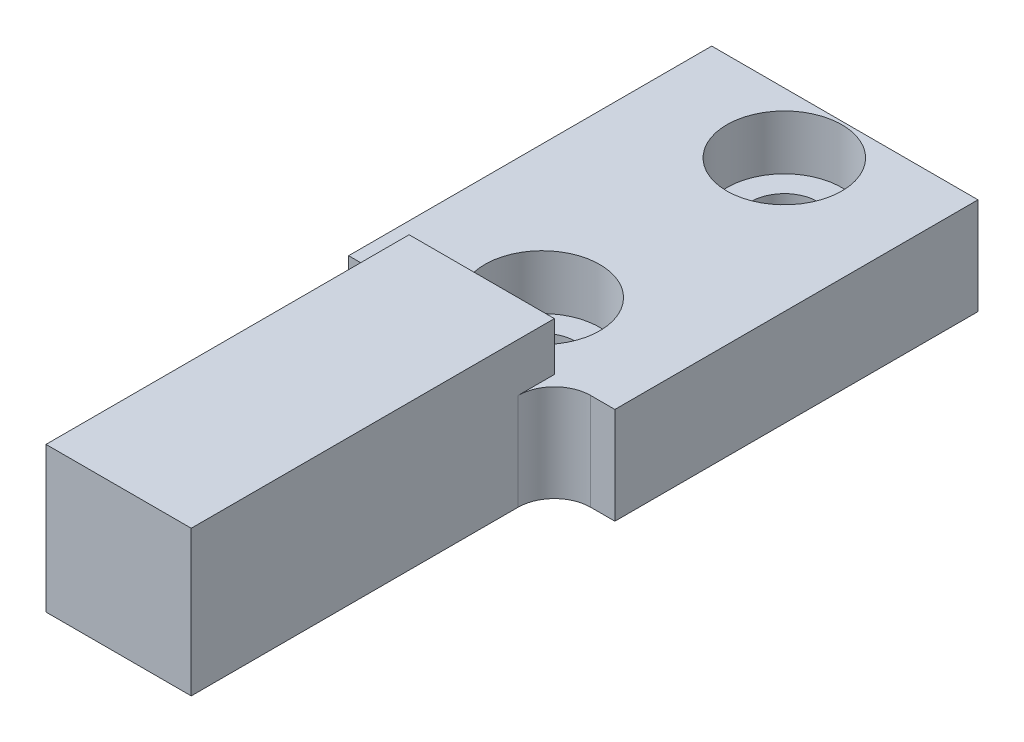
ISO-10303-21;
HEADER;
FILE_DESCRIPTION(('STEP AP214'),'2;1');
FILE_NAME('part.step','',(''),(''),'','','');
FILE_SCHEMA(('AUTOMOTIVE_DESIGN { 1 0 10303 214 1 1 1 1 }'));
ENDSEC;
DATA;
#1=APPLICATION_CONTEXT('core data for automotive mechanical design processes');
#2=APPLICATION_PROTOCOL_DEFINITION('international standard','automotive_design',2000,#1);
#3=PRODUCT_CONTEXT('',#1,'mechanical');
#4=PRODUCT('Part','Part','',(#3));
#5=PRODUCT_RELATED_PRODUCT_CATEGORY('part','',(#4));
#6=PRODUCT_DEFINITION_FORMATION('','',#4);
#7=PRODUCT_DEFINITION_CONTEXT('part definition',#1,'design');
#8=PRODUCT_DEFINITION('design','',#6,#7);
#9=PRODUCT_DEFINITION_SHAPE('','',#8);
#10=(LENGTH_UNIT() NAMED_UNIT(*) SI_UNIT(.MILLI.,.METRE.));
#11=(NAMED_UNIT(*) PLANE_ANGLE_UNIT() SI_UNIT($,.RADIAN.));
#12=(NAMED_UNIT(*) SI_UNIT($,.STERADIAN.) SOLID_ANGLE_UNIT());
#13=UNCERTAINTY_MEASURE_WITH_UNIT(LENGTH_MEASURE(1.E-05),#10,'distance_accuracy_value','');
#14=(GEOMETRIC_REPRESENTATION_CONTEXT(3) GLOBAL_UNCERTAINTY_ASSIGNED_CONTEXT((#13)) GLOBAL_UNIT_ASSIGNED_CONTEXT((#10,
#11,#12)) REPRESENTATION_CONTEXT('',''));
#15=CARTESIAN_POINT('',(0.,0.,0.));
#16=DIRECTION('',(0.,0.,1.));
#17=DIRECTION('',(1.,0.,0.));
#18=AXIS2_PLACEMENT_3D('',#15,#16,#17);
#19=CARTESIAN_POINT('',(11.,71.9999999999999,25.));
#20=DIRECTION('',(0.,-1.,0.));
#21=DIRECTION('',(0.,0.,-1.));
#22=AXIS2_PLACEMENT_3D('',#19,#20,#21);
#23=CYLINDRICAL_SURFACE('',#22,2.75);
#24=CARTESIAN_POINT('',(11.,-1.11022302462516E-13,25.));
#25=DIRECTION('',(0.,1.,0.));
#26=DIRECTION('',(0.,0.,1.));
#27=AXIS2_PLACEMENT_3D('',#24,#25,#26);
#28=CIRCLE('',#27,2.75);
#29=CARTESIAN_POINT('',(11.,-1.11022302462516E-13,27.75));
#30=VERTEX_POINT('',#29);
#31=EDGE_CURVE('E136',#30,#30,#28,.F.);
#32=ORIENTED_EDGE('',*,*,#31,.T.);
#33=EDGE_LOOP('',(#32));
#34=FACE_BOUND('',#33,.T.);
#35=CARTESIAN_POINT('',(11.,3.49999999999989,25.));
#36=DIRECTION('',(0.,1.,0.));
#37=DIRECTION('',(0.,0.,1.));
#38=AXIS2_PLACEMENT_3D('',#35,#36,#37);
#39=CIRCLE('',#38,2.75);
#40=CARTESIAN_POINT('',(11.,3.49999999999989,27.75));
#41=VERTEX_POINT('',#40);
#42=EDGE_CURVE('E38',#41,#41,#39,.T.);
#43=ORIENTED_EDGE('',*,*,#42,.T.);
#44=EDGE_LOOP('',(#43));
#45=FACE_BOUND('',#44,.T.);
#46=ADVANCED_FACE('F34',(#34,#45),#23,.F.);
#47=CARTESIAN_POINT('',(11.,71.9999999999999,5.));
#48=DIRECTION('',(0.,-1.,0.));
#49=DIRECTION('',(0.,0.,-1.));
#50=AXIS2_PLACEMENT_3D('',#47,#48,#49);
#51=CYLINDRICAL_SURFACE('',#50,2.75);
#52=CARTESIAN_POINT('',(11.,-1.11022302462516E-13,5.));
#53=DIRECTION('',(0.,1.,0.));
#54=DIRECTION('',(0.,0.,1.));
#55=AXIS2_PLACEMENT_3D('',#52,#53,#54);
#56=CIRCLE('',#55,2.75);
#57=CARTESIAN_POINT('',(11.,-1.11022302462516E-13,7.75));
#58=VERTEX_POINT('',#57);
#59=EDGE_CURVE('E141',#58,#58,#56,.F.);
#60=ORIENTED_EDGE('',*,*,#59,.T.);
#61=EDGE_LOOP('',(#60));
#62=FACE_BOUND('',#61,.T.);
#63=CARTESIAN_POINT('',(11.,3.49999999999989,5.));
#64=DIRECTION('',(0.,1.,0.));
#65=DIRECTION('',(0.,0.,1.));
#66=AXIS2_PLACEMENT_3D('',#63,#64,#65);
#67=CIRCLE('',#66,2.75);
#68=CARTESIAN_POINT('',(11.,3.49999999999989,7.75));
#69=VERTEX_POINT('',#68);
#70=EDGE_CURVE('E134',#69,#69,#67,.T.);
#71=ORIENTED_EDGE('',*,*,#70,.T.);
#72=EDGE_LOOP('',(#71));
#73=FACE_BOUND('',#72,.T.);
#74=ADVANCED_FACE('F284',(#62,#73),#51,.F.);
#75=CARTESIAN_POINT('',(0.,-1.13686837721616E-13,60.));
#76=DIRECTION('',(0.,1.,0.));
#77=DIRECTION('',(0.,0.,1.));
#78=AXIS2_PLACEMENT_3D('',#75,#76,#77);
#79=PLANE('',#78);
#80=ORIENTED_EDGE('',*,*,#59,.F.);
#81=EDGE_LOOP('',(#80));
#82=FACE_BOUND('',#81,.T.);
#83=CARTESIAN_POINT('',(20.,-1.11022302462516E-13,33.));
#84=DIRECTION('',(0.,1.,0.));
#85=DIRECTION('',(0.,0.,1.));
#86=AXIS2_PLACEMENT_3D('',#83,#84,#85);
#87=CIRCLE('',#86,3.);
#88=CARTESIAN_POINT('',(20.,-1.11022302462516E-13,30.));
#89=VERTEX_POINT('',#88);
#90=CARTESIAN_POINT('',(17.,-1.11022302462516E-13,33.));
#91=VERTEX_POINT('',#90);
#92=EDGE_CURVE('E188',#89,#91,#87,.T.);
#93=ORIENTED_EDGE('',*,*,#92,.T.);
#94=DIRECTION('',(0.,0.,1.));
#95=VECTOR('',#94,1.);
#96=CARTESIAN_POINT('',(17.,-1.13686837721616E-13,60.));
#97=LINE('',#96,#95);
#98=CARTESIAN_POINT('',(17.,-1.11022302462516E-13,60.));
#99=VERTEX_POINT('',#98);
#100=EDGE_CURVE('E176',#91,#99,#97,.T.);
#101=ORIENTED_EDGE('',*,*,#100,.T.);
#102=DIRECTION('',(1.,0.,0.));
#103=VECTOR('',#102,1.);
#104=CARTESIAN_POINT('',(0.,-1.13686837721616E-13,60.));
#105=LINE('',#104,#103);
#106=CARTESIAN_POINT('',(5.,-1.13686837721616E-13,60.));
#107=VERTEX_POINT('',#106);
#108=EDGE_CURVE('E201',#107,#99,#105,.T.);
#109=ORIENTED_EDGE('',*,*,#108,.F.);
#110=DIRECTION('',(0.,0.,-1.));
#111=VECTOR('',#110,1.);
#112=CARTESIAN_POINT('',(5.,-1.13686837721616E-13,60.));
#113=LINE('',#112,#111);
#114=CARTESIAN_POINT('',(5.,-1.11022302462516E-13,33.));
#115=VERTEX_POINT('',#114);
#116=EDGE_CURVE('E173',#107,#115,#113,.T.);
#117=ORIENTED_EDGE('',*,*,#116,.T.);
#118=CARTESIAN_POINT('',(2.,-1.11022302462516E-13,33.));
#119=DIRECTION('',(0.,1.,0.));
#120=DIRECTION('',(0.,0.,1.));
#121=AXIS2_PLACEMENT_3D('',#118,#119,#120);
#122=CIRCLE('',#121,3.);
#123=CARTESIAN_POINT('',(2.,-1.11022302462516E-13,30.));
#124=VERTEX_POINT('',#123);
#125=EDGE_CURVE('E179',#115,#124,#122,.T.);
#126=ORIENTED_EDGE('',*,*,#125,.T.);
#127=DIRECTION('',(-1.,0.,0.));
#128=VECTOR('',#127,1.);
#129=CARTESIAN_POINT('',(0.,-1.13686837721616E-13,30.));
#130=LINE('',#129,#128);
#131=CARTESIAN_POINT('',(0.,-1.11022302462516E-13,30.));
#132=VERTEX_POINT('',#131);
#133=EDGE_CURVE('E182',#124,#132,#130,.T.);
#134=ORIENTED_EDGE('',*,*,#133,.T.);
#135=DIRECTION('',(0.,0.,-1.));
#136=VECTOR('',#135,1.);
#137=CARTESIAN_POINT('',(0.,-1.13686837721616E-13,60.));
#138=LINE('',#137,#136);
#139=CARTESIAN_POINT('',(0.,-1.13686837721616E-13,0.));
#140=VERTEX_POINT('',#139);
#141=EDGE_CURVE('E115',#132,#140,#138,.T.);
#142=ORIENTED_EDGE('',*,*,#141,.T.);
#143=DIRECTION('',(1.,0.,0.));
#144=VECTOR('',#143,1.);
#145=CARTESIAN_POINT('',(0.,-1.13686837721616E-13,0.));
#146=LINE('',#145,#144);
#147=CARTESIAN_POINT('',(22.,-1.13686837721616E-13,0.));
#148=VERTEX_POINT('',#147);
#149=EDGE_CURVE('E99',#140,#148,#146,.T.);
#150=ORIENTED_EDGE('',*,*,#149,.T.);
#151=DIRECTION('',(0.,0.,-1.));
#152=VECTOR('',#151,1.);
#153=CARTESIAN_POINT('',(22.,-1.13686837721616E-13,60.));
#154=LINE('',#153,#152);
#155=CARTESIAN_POINT('',(22.,-1.11022302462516E-13,30.));
#156=VERTEX_POINT('',#155);
#157=EDGE_CURVE('E89',#156,#148,#154,.T.);
#158=ORIENTED_EDGE('',*,*,#157,.F.);
#159=DIRECTION('',(-1.,0.,0.));
#160=VECTOR('',#159,1.);
#161=CARTESIAN_POINT('',(0.,-1.13686837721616E-13,30.));
#162=LINE('',#161,#160);
#163=EDGE_CURVE('E185',#156,#89,#162,.T.);
#164=ORIENTED_EDGE('',*,*,#163,.T.);
#165=EDGE_LOOP('',(#93,#101,#109,#117,#126,#134,#142,#150,#158,#164));
#166=FACE_BOUND('',#165,.T.);
#167=ORIENTED_EDGE('',*,*,#31,.F.);
#168=EDGE_LOOP('',(#167));
#169=FACE_BOUND('',#168,.T.);
#170=ADVANCED_FACE('F205',(#82,#166,#169),#79,.F.);
#171=CARTESIAN_POINT('',(17.,7.99999999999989,60.));
#172=DIRECTION('',(0.,-1.,0.));
#173=DIRECTION('',(0.,0.,-1.));
#174=AXIS2_PLACEMENT_3D('',#171,#172,#173);
#175=PLANE('',#174);
#176=CARTESIAN_POINT('',(11.,7.99999999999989,25.));
#177=DIRECTION('',(0.,1.,0.));
#178=DIRECTION('',(0.,0.,1.));
#179=AXIS2_PLACEMENT_3D('',#176,#177,#178);
#180=CIRCLE('',#179,4.75);
#181=CARTESIAN_POINT('',(11.,7.99999999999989,29.75));
#182=VERTEX_POINT('',#181);
#183=EDGE_CURVE('E151',#182,#182,#180,.T.);
#184=ORIENTED_EDGE('',*,*,#183,.F.);
#185=EDGE_LOOP('',(#184));
#186=FACE_BOUND('',#185,.T.);
#187=CARTESIAN_POINT('',(11.,7.99999999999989,5.));
#188=DIRECTION('',(0.,1.,0.));
#189=DIRECTION('',(0.,0.,1.));
#190=AXIS2_PLACEMENT_3D('',#187,#188,#189);
#191=CIRCLE('',#190,4.75);
#192=CARTESIAN_POINT('',(11.,7.99999999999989,9.75));
#193=VERTEX_POINT('',#192);
#194=EDGE_CURVE('E144',#193,#193,#191,.T.);
#195=ORIENTED_EDGE('',*,*,#194,.F.);
#196=EDGE_LOOP('',(#195));
#197=FACE_BOUND('',#196,.T.);
#198=DIRECTION('',(0.,0.,-1.));
#199=VECTOR('',#198,1.);
#200=CARTESIAN_POINT('',(17.,7.99999999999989,60.));
#201=LINE('',#200,#199);
#202=CARTESIAN_POINT('',(17.,7.99999999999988,33.));
#203=VERTEX_POINT('',#202);
#204=CARTESIAN_POINT('',(17.,8.00000000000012,30.));
#205=VERTEX_POINT('',#204);
#206=EDGE_CURVE('E90',#203,#205,#201,.T.);
#207=ORIENTED_EDGE('',*,*,#206,.F.);
#208=CARTESIAN_POINT('',(20.,7.99999999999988,33.));
#209=DIRECTION('',(0.,-1.,0.));
#210=DIRECTION('',(0.,0.,-1.));
#211=AXIS2_PLACEMENT_3D('',#208,#209,#210);
#212=CIRCLE('',#211,3.);
#213=CARTESIAN_POINT('',(20.,7.99999999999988,30.));
#214=VERTEX_POINT('',#213);
#215=EDGE_CURVE('E12',#203,#214,#212,.T.);
#216=ORIENTED_EDGE('',*,*,#215,.T.);
#217=DIRECTION('',(1.,0.,0.));
#218=VECTOR('',#217,1.);
#219=CARTESIAN_POINT('',(17.,7.99999999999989,30.));
#220=LINE('',#219,#218);
#221=CARTESIAN_POINT('',(22.,7.99999999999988,30.));
#222=VERTEX_POINT('',#221);
#223=EDGE_CURVE('E43',#214,#222,#220,.T.);
#224=ORIENTED_EDGE('',*,*,#223,.T.);
#225=DIRECTION('',(0.,0.,-1.));
#226=VECTOR('',#225,1.);
#227=CARTESIAN_POINT('',(22.,7.99999999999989,60.));
#228=LINE('',#227,#226);
#229=CARTESIAN_POINT('',(22.,7.99999999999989,0.));
#230=VERTEX_POINT('',#229);
#231=EDGE_CURVE('E77',#222,#230,#228,.T.);
#232=ORIENTED_EDGE('',*,*,#231,.T.);
#233=DIRECTION('',(-1.,0.,0.));
#234=VECTOR('',#233,1.);
#235=CARTESIAN_POINT('',(17.,7.99999999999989,0.));
#236=LINE('',#235,#234);
#237=CARTESIAN_POINT('',(0.,7.99999999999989,0.));
#238=VERTEX_POINT('',#237);
#239=EDGE_CURVE('E83',#230,#238,#236,.T.);
#240=ORIENTED_EDGE('',*,*,#239,.T.);
#241=DIRECTION('',(0.,0.,-1.));
#242=VECTOR('',#241,1.);
#243=CARTESIAN_POINT('',(0.,7.99999999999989,60.));
#244=LINE('',#243,#242);
#245=CARTESIAN_POINT('',(0.,7.99999999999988,30.));
#246=VERTEX_POINT('',#245);
#247=EDGE_CURVE('E117',#246,#238,#244,.T.);
#248=ORIENTED_EDGE('',*,*,#247,.F.);
#249=DIRECTION('',(1.,0.,0.));
#250=VECTOR('',#249,1.);
#251=CARTESIAN_POINT('',(17.,7.99999999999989,30.));
#252=LINE('',#251,#250);
#253=CARTESIAN_POINT('',(2.,7.99999999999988,30.));
#254=VERTEX_POINT('',#253);
#255=EDGE_CURVE('E131',#246,#254,#252,.T.);
#256=ORIENTED_EDGE('',*,*,#255,.T.);
#257=CARTESIAN_POINT('',(2.,7.99999999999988,33.));
#258=DIRECTION('',(0.,-1.,0.));
#259=DIRECTION('',(0.,0.,-1.));
#260=AXIS2_PLACEMENT_3D('',#257,#258,#259);
#261=CIRCLE('',#260,3.);
#262=CARTESIAN_POINT('',(5.,7.99999999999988,33.));
#263=VERTEX_POINT('',#262);
#264=EDGE_CURVE('E128',#254,#263,#261,.T.);
#265=ORIENTED_EDGE('',*,*,#264,.T.);
#266=DIRECTION('',(0.,0.,-1.));
#267=VECTOR('',#266,1.);
#268=CARTESIAN_POINT('',(5.,8.,60.));
#269=LINE('',#268,#267);
#270=CARTESIAN_POINT('',(5.,8.00000000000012,30.));
#271=VERTEX_POINT('',#270);
#272=EDGE_CURVE('E119',#263,#271,#269,.T.);
#273=ORIENTED_EDGE('',*,*,#272,.T.);
#274=DIRECTION('',(1.,0.,0.));
#275=VECTOR('',#274,1.);
#276=CARTESIAN_POINT('',(-38.,8.00000000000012,30.));
#277=LINE('',#276,#275);
#278=EDGE_CURVE('E191',#271,#205,#277,.T.);
#279=ORIENTED_EDGE('',*,*,#278,.T.);
#280=EDGE_LOOP('',(#207,#216,#224,#232,#240,#248,#256,#265,#273,#279));
#281=FACE_BOUND('',#280,.T.);
#282=ADVANCED_FACE('F80',(#186,#197,#281),#175,.F.);
#283=CARTESIAN_POINT('',(5.,11.9999999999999,60.));
#284=DIRECTION('',(0.,-1.,0.));
#285=DIRECTION('',(0.,0.,-1.));
#286=AXIS2_PLACEMENT_3D('',#283,#284,#285);
#287=PLANE('',#286);
#288=DIRECTION('',(1.,0.,0.));
#289=VECTOR('',#288,1.);
#290=CARTESIAN_POINT('',(-38.,11.9999999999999,30.));
#291=LINE('',#290,#289);
#292=CARTESIAN_POINT('',(5.,11.9999999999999,30.));
#293=VERTEX_POINT('',#292);
#294=CARTESIAN_POINT('',(17.,11.9999999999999,30.));
#295=VERTEX_POINT('',#294);
#296=EDGE_CURVE('E192',#293,#295,#291,.T.);
#297=ORIENTED_EDGE('',*,*,#296,.F.);
#298=DIRECTION('',(0.,0.,-1.));
#299=VECTOR('',#298,1.);
#300=CARTESIAN_POINT('',(5.,11.9999999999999,60.));
#301=LINE('',#300,#299);
#302=CARTESIAN_POINT('',(5.,11.9999999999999,60.));
#303=VERTEX_POINT('',#302);
#304=EDGE_CURVE('E122',#303,#293,#301,.T.);
#305=ORIENTED_EDGE('',*,*,#304,.F.);
#306=DIRECTION('',(-1.,0.,0.));
#307=VECTOR('',#306,1.);
#308=CARTESIAN_POINT('',(5.,11.9999999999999,60.));
#309=LINE('',#308,#307);
#310=CARTESIAN_POINT('',(17.,11.9999999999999,60.));
#311=VERTEX_POINT('',#310);
#312=EDGE_CURVE('E104',#311,#303,#309,.T.);
#313=ORIENTED_EDGE('',*,*,#312,.F.);
#314=DIRECTION('',(0.,0.,-1.));
#315=VECTOR('',#314,1.);
#316=CARTESIAN_POINT('',(17.,11.9999999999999,60.));
#317=LINE('',#316,#315);
#318=EDGE_CURVE('E109',#311,#295,#317,.T.);
#319=ORIENTED_EDGE('',*,*,#318,.T.);
#320=EDGE_LOOP('',(#297,#305,#313,#319));
#321=FACE_BOUND('',#320,.T.);
#322=ADVANCED_FACE('F36',(#321),#287,.F.);
#323=CARTESIAN_POINT('',(5.,8.,60.));
#324=DIRECTION('',(1.,0.,0.));
#325=DIRECTION('',(0.,0.,-1.));
#326=AXIS2_PLACEMENT_3D('',#323,#324,#325);
#327=PLANE('',#326);
#328=ORIENTED_EDGE('',*,*,#304,.T.);
#329=DIRECTION('',(0.,1.,0.));
#330=VECTOR('',#329,1.);
#331=CARTESIAN_POINT('',(5.,8.,30.));
#332=LINE('',#331,#330);
#333=EDGE_CURVE('E195',#271,#293,#332,.T.);
#334=ORIENTED_EDGE('',*,*,#333,.F.);
#335=ORIENTED_EDGE('',*,*,#272,.F.);
#336=DIRECTION('',(0.,-1.,0.));
#337=VECTOR('',#336,1.);
#338=CARTESIAN_POINT('',(5.,71.9999999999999,33.));
#339=LINE('',#338,#337);
#340=EDGE_CURVE('E156',#263,#115,#339,.T.);
#341=ORIENTED_EDGE('',*,*,#340,.T.);
#342=ORIENTED_EDGE('',*,*,#116,.F.);
#343=DIRECTION('',(0.,-1.,0.));
#344=VECTOR('',#343,1.);
#345=CARTESIAN_POINT('',(5.,8.,60.));
#346=LINE('',#345,#344);
#347=EDGE_CURVE('E51',#303,#107,#346,.T.);
#348=ORIENTED_EDGE('',*,*,#347,.F.);
#349=EDGE_LOOP('',(#328,#334,#335,#341,#342,#348));
#350=FACE_BOUND('',#349,.T.);
#351=ADVANCED_FACE('F330',(#350),#327,.F.);
#352=CARTESIAN_POINT('',(17.,7.99999999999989,60.));
#353=DIRECTION('',(-1.,0.,0.));
#354=DIRECTION('',(0.,0.,1.));
#355=AXIS2_PLACEMENT_3D('',#352,#353,#354);
#356=PLANE('',#355);
#357=DIRECTION('',(0.,-1.,0.));
#358=VECTOR('',#357,1.);
#359=CARTESIAN_POINT('',(17.,7.99999999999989,30.));
#360=LINE('',#359,#358);
#361=EDGE_CURVE('E125',#295,#205,#360,.T.);
#362=ORIENTED_EDGE('',*,*,#361,.F.);
#363=ORIENTED_EDGE('',*,*,#318,.F.);
#364=DIRECTION('',(0.,1.,0.));
#365=VECTOR('',#364,1.);
#366=CARTESIAN_POINT('',(17.,7.99999999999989,60.));
#367=LINE('',#366,#365);
#368=EDGE_CURVE('E57',#99,#311,#367,.T.);
#369=ORIENTED_EDGE('',*,*,#368,.F.);
#370=ORIENTED_EDGE('',*,*,#100,.F.);
#371=DIRECTION('',(0.,-1.,0.));
#372=VECTOR('',#371,1.);
#373=CARTESIAN_POINT('',(17.,71.9999999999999,33.));
#374=LINE('',#373,#372);
#375=EDGE_CURVE('E170',#203,#91,#374,.T.);
#376=ORIENTED_EDGE('',*,*,#375,.F.);
#377=ORIENTED_EDGE('',*,*,#206,.T.);
#378=EDGE_LOOP('',(#362,#363,#369,#370,#376,#377));
#379=FACE_BOUND('',#378,.T.);
#380=ADVANCED_FACE('F249',(#379),#356,.F.);
#381=CARTESIAN_POINT('',(17.,11.9999999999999,0.));
#382=DIRECTION('',(0.,0.,1.));
#383=DIRECTION('',(1.,0.,0.));
#384=AXIS2_PLACEMENT_3D('',#381,#382,#383);
#385=PLANE('',#384);
#386=DIRECTION('',(0.,-1.,0.));
#387=VECTOR('',#386,1.);
#388=CARTESIAN_POINT('',(0.,-1.13686837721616E-13,0.));
#389=LINE('',#388,#387);
#390=EDGE_CURVE('E103',#238,#140,#389,.T.);
#391=ORIENTED_EDGE('',*,*,#390,.F.);
#392=ORIENTED_EDGE('',*,*,#239,.F.);
#393=DIRECTION('',(0.,1.,0.));
#394=VECTOR('',#393,1.);
#395=CARTESIAN_POINT('',(22.,-1.13686837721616E-13,0.));
#396=LINE('',#395,#394);
#397=EDGE_CURVE('E93',#148,#230,#396,.T.);
#398=ORIENTED_EDGE('',*,*,#397,.F.);
#399=ORIENTED_EDGE('',*,*,#149,.F.);
#400=EDGE_LOOP('',(#391,#392,#398,#399));
#401=FACE_BOUND('',#400,.T.);
#402=ADVANCED_FACE('F101',(#401),#385,.F.);
#403=CARTESIAN_POINT('',(0.,-1.13686837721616E-13,60.));
#404=DIRECTION('',(1.,0.,0.));
#405=DIRECTION('',(0.,0.,-1.));
#406=AXIS2_PLACEMENT_3D('',#403,#404,#405);
#407=PLANE('',#406);
#408=ORIENTED_EDGE('',*,*,#141,.F.);
#409=DIRECTION('',(0.,-1.,0.));
#410=VECTOR('',#409,1.);
#411=CARTESIAN_POINT('',(0.,71.9999999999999,30.));
#412=LINE('',#411,#410);
#413=EDGE_CURVE('E162',#246,#132,#412,.T.);
#414=ORIENTED_EDGE('',*,*,#413,.F.);
#415=ORIENTED_EDGE('',*,*,#247,.T.);
#416=ORIENTED_EDGE('',*,*,#390,.T.);
#417=EDGE_LOOP('',(#408,#414,#415,#416));
#418=FACE_BOUND('',#417,.T.);
#419=ADVANCED_FACE('F213',(#418),#407,.F.);
#420=CARTESIAN_POINT('',(22.,-1.13686837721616E-13,60.));
#421=DIRECTION('',(-1.,0.,0.));
#422=DIRECTION('',(0.,0.,1.));
#423=AXIS2_PLACEMENT_3D('',#420,#421,#422);
#424=PLANE('',#423);
#425=ORIENTED_EDGE('',*,*,#231,.F.);
#426=DIRECTION('',(0.,-1.,0.));
#427=VECTOR('',#426,1.);
#428=CARTESIAN_POINT('',(22.,71.9999999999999,30.));
#429=LINE('',#428,#427);
#430=EDGE_CURVE('E165',#222,#156,#429,.T.);
#431=ORIENTED_EDGE('',*,*,#430,.T.);
#432=ORIENTED_EDGE('',*,*,#157,.T.);
#433=ORIENTED_EDGE('',*,*,#397,.T.);
#434=EDGE_LOOP('',(#425,#431,#432,#433));
#435=FACE_BOUND('',#434,.T.);
#436=ADVANCED_FACE('F94',(#435),#424,.F.);
#437=CARTESIAN_POINT('',(17.,11.9999999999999,60.));
#438=DIRECTION('',(0.,0.,1.));
#439=DIRECTION('',(1.,0.,0.));
#440=AXIS2_PLACEMENT_3D('',#437,#438,#439);
#441=PLANE('',#440);
#442=ORIENTED_EDGE('',*,*,#108,.T.);
#443=ORIENTED_EDGE('',*,*,#368,.T.);
#444=ORIENTED_EDGE('',*,*,#312,.T.);
#445=ORIENTED_EDGE('',*,*,#347,.T.);
#446=EDGE_LOOP('',(#442,#443,#444,#445));
#447=FACE_BOUND('',#446,.T.);
#448=ADVANCED_FACE('F337',(#447),#441,.T.);
#449=CARTESIAN_POINT('',(-38.,8.00000000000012,30.));
#450=DIRECTION('',(0.,0.,-1.));
#451=DIRECTION('',(-1.,0.,0.));
#452=AXIS2_PLACEMENT_3D('',#449,#450,#451);
#453=PLANE('',#452);
#454=ORIENTED_EDGE('',*,*,#333,.T.);
#455=ORIENTED_EDGE('',*,*,#296,.T.);
#456=ORIENTED_EDGE('',*,*,#361,.T.);
#457=ORIENTED_EDGE('',*,*,#278,.F.);
#458=EDGE_LOOP('',(#454,#455,#456,#457));
#459=FACE_BOUND('',#458,.T.);
#460=ADVANCED_FACE('F246',(#459),#453,.T.);
#461=CARTESIAN_POINT('',(2.,71.9999999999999,33.));
#462=DIRECTION('',(0.,-1.,0.));
#463=DIRECTION('',(0.,0.,-1.));
#464=AXIS2_PLACEMENT_3D('',#461,#462,#463);
#465=CYLINDRICAL_SURFACE('',#464,3.);
#466=ORIENTED_EDGE('',*,*,#340,.F.);
#467=ORIENTED_EDGE('',*,*,#264,.F.);
#468=DIRECTION('',(0.,-1.,0.));
#469=VECTOR('',#468,1.);
#470=CARTESIAN_POINT('',(2.,71.9999999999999,30.));
#471=LINE('',#470,#469);
#472=EDGE_CURVE('E159',#254,#124,#471,.T.);
#473=ORIENTED_EDGE('',*,*,#472,.T.);
#474=ORIENTED_EDGE('',*,*,#125,.F.);
#475=EDGE_LOOP('',(#466,#467,#473,#474));
#476=FACE_BOUND('',#475,.T.);
#477=ADVANCED_FACE('F269',(#476),#465,.F.);
#478=CARTESIAN_POINT('',(0.,71.9999999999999,30.));
#479=DIRECTION('',(0.,0.,-1.));
#480=DIRECTION('',(-1.,0.,0.));
#481=AXIS2_PLACEMENT_3D('',#478,#479,#480);
#482=PLANE('',#481);
#483=ORIENTED_EDGE('',*,*,#472,.F.);
#484=ORIENTED_EDGE('',*,*,#255,.F.);
#485=ORIENTED_EDGE('',*,*,#413,.T.);
#486=ORIENTED_EDGE('',*,*,#133,.F.);
#487=EDGE_LOOP('',(#483,#484,#485,#486));
#488=FACE_BOUND('',#487,.T.);
#489=ADVANCED_FACE('F271',(#488),#482,.F.);
#490=CARTESIAN_POINT('',(20.,71.9999999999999,33.));
#491=DIRECTION('',(0.,-1.,0.));
#492=DIRECTION('',(0.,0.,-1.));
#493=AXIS2_PLACEMENT_3D('',#490,#491,#492);
#494=CYLINDRICAL_SURFACE('',#493,3.);
#495=DIRECTION('',(0.,-1.,0.));
#496=VECTOR('',#495,1.);
#497=CARTESIAN_POINT('',(20.,71.9999999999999,30.));
#498=LINE('',#497,#496);
#499=EDGE_CURVE('E167',#214,#89,#498,.T.);
#500=ORIENTED_EDGE('',*,*,#499,.F.);
#501=ORIENTED_EDGE('',*,*,#215,.F.);
#502=ORIENTED_EDGE('',*,*,#375,.T.);
#503=ORIENTED_EDGE('',*,*,#92,.F.);
#504=EDGE_LOOP('',(#500,#501,#502,#503));
#505=FACE_BOUND('',#504,.T.);
#506=ADVANCED_FACE('F273',(#505),#494,.F.);
#507=CARTESIAN_POINT('',(20.,71.9999999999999,30.));
#508=DIRECTION('',(0.,0.,-1.));
#509=DIRECTION('',(-1.,0.,0.));
#510=AXIS2_PLACEMENT_3D('',#507,#508,#509);
#511=PLANE('',#510);
#512=ORIENTED_EDGE('',*,*,#430,.F.);
#513=ORIENTED_EDGE('',*,*,#223,.F.);
#514=ORIENTED_EDGE('',*,*,#499,.T.);
#515=ORIENTED_EDGE('',*,*,#163,.F.);
#516=EDGE_LOOP('',(#512,#513,#514,#515));
#517=FACE_BOUND('',#516,.T.);
#518=ADVANCED_FACE('F279',(#517),#511,.F.);
#519=CARTESIAN_POINT('',(11.,3.49999999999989,5.));
#520=DIRECTION('',(0.,1.,0.));
#521=DIRECTION('',(0.,0.,1.));
#522=AXIS2_PLACEMENT_3D('',#519,#520,#521);
#523=CYLINDRICAL_SURFACE('',#522,4.75);
#524=CARTESIAN_POINT('',(11.,3.49999999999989,5.));
#525=DIRECTION('',(0.,1.,0.));
#526=DIRECTION('',(0.,0.,1.));
#527=AXIS2_PLACEMENT_3D('',#524,#525,#526);
#528=CIRCLE('',#527,4.75);
#529=CARTESIAN_POINT('',(11.,3.49999999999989,9.75));
#530=VERTEX_POINT('',#529);
#531=EDGE_CURVE('E137',#530,#530,#528,.T.);
#532=ORIENTED_EDGE('',*,*,#531,.F.);
#533=EDGE_LOOP('',(#532));
#534=FACE_BOUND('',#533,.T.);
#535=ORIENTED_EDGE('',*,*,#194,.T.);
#536=EDGE_LOOP('',(#535));
#537=FACE_BOUND('',#536,.T.);
#538=ADVANCED_FACE('F294',(#534,#537),#523,.F.);
#539=CARTESIAN_POINT('',(11.,3.49999999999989,5.));
#540=DIRECTION('',(0.,1.,0.));
#541=DIRECTION('',(0.,0.,1.));
#542=AXIS2_PLACEMENT_3D('',#539,#540,#541);
#543=PLANE('',#542);
#544=ORIENTED_EDGE('',*,*,#70,.F.);
#545=EDGE_LOOP('',(#544));
#546=FACE_BOUND('',#545,.T.);
#547=ORIENTED_EDGE('',*,*,#531,.T.);
#548=EDGE_LOOP('',(#547));
#549=FACE_BOUND('',#548,.T.);
#550=ADVANCED_FACE('F297',(#546,#549),#543,.T.);
#551=CARTESIAN_POINT('',(11.,3.49999999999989,25.));
#552=DIRECTION('',(0.,1.,0.));
#553=DIRECTION('',(0.,0.,1.));
#554=AXIS2_PLACEMENT_3D('',#551,#552,#553);
#555=CYLINDRICAL_SURFACE('',#554,4.75);
#556=CARTESIAN_POINT('',(11.,3.49999999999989,25.));
#557=DIRECTION('',(0.,1.,0.));
#558=DIRECTION('',(0.,0.,1.));
#559=AXIS2_PLACEMENT_3D('',#556,#557,#558);
#560=CIRCLE('',#559,4.75);
#561=CARTESIAN_POINT('',(11.,3.49999999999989,29.75));
#562=VERTEX_POINT('',#561);
#563=EDGE_CURVE('E316',#562,#562,#560,.T.);
#564=ORIENTED_EDGE('',*,*,#563,.F.);
#565=EDGE_LOOP('',(#564));
#566=FACE_BOUND('',#565,.T.);
#567=ORIENTED_EDGE('',*,*,#183,.T.);
#568=EDGE_LOOP('',(#567));
#569=FACE_BOUND('',#568,.T.);
#570=ADVANCED_FACE('F301',(#566,#569),#555,.F.);
#571=CARTESIAN_POINT('',(11.,3.49999999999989,25.));
#572=DIRECTION('',(0.,1.,0.));
#573=DIRECTION('',(0.,0.,1.));
#574=AXIS2_PLACEMENT_3D('',#571,#572,#573);
#575=PLANE('',#574);
#576=ORIENTED_EDGE('',*,*,#42,.F.);
#577=EDGE_LOOP('',(#576));
#578=FACE_BOUND('',#577,.T.);
#579=ORIENTED_EDGE('',*,*,#563,.T.);
#580=EDGE_LOOP('',(#579));
#581=FACE_BOUND('',#580,.T.);
#582=ADVANCED_FACE('F305',(#578,#581),#575,.T.);
#583=CLOSED_SHELL('',(#46,#74,#170,#282,#322,#351,#380,#402,#419,#436,#448,#460,#477,#489,#506,
#518,#538,#550,#570,#582));
#584=MANIFOLD_SOLID_BREP('B2',#583);
#585=ADVANCED_BREP_SHAPE_REPRESENTATION('',(#18,#584),#14);
#586=SHAPE_DEFINITION_REPRESENTATION(#9,#585);
ENDSEC;
END-ISO-10303-21;
